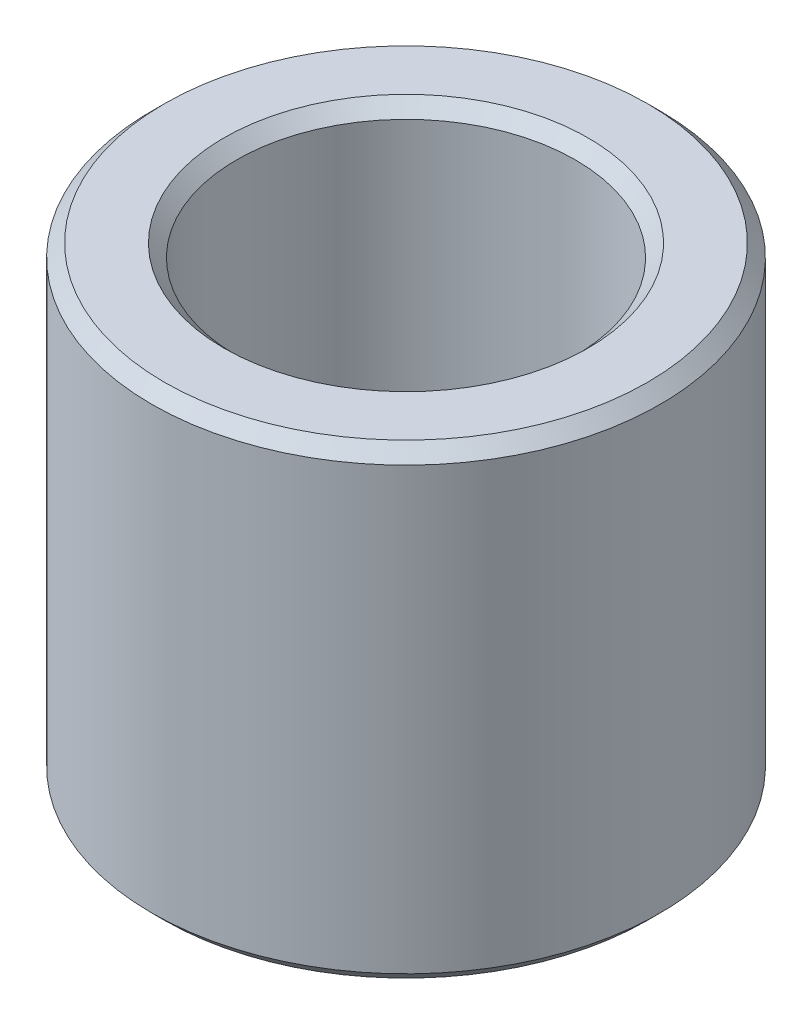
ISO-10303-21;
HEADER;
FILE_DESCRIPTION(('STEP AP214'),'2;1');
FILE_NAME('part.step','',(''),(''),'','','');
FILE_SCHEMA(('AUTOMOTIVE_DESIGN { 1 0 10303 214 1 1 1 1 }'));
ENDSEC;
DATA;
#1=APPLICATION_CONTEXT('core data for automotive mechanical design processes');
#2=APPLICATION_PROTOCOL_DEFINITION('international standard','automotive_design',2000,#1);
#3=PRODUCT_CONTEXT('',#1,'mechanical');
#4=PRODUCT('Part','Part','',(#3));
#5=PRODUCT_RELATED_PRODUCT_CATEGORY('part','',(#4));
#6=PRODUCT_DEFINITION_FORMATION('','',#4);
#7=PRODUCT_DEFINITION_CONTEXT('part definition',#1,'design');
#8=PRODUCT_DEFINITION('design','',#6,#7);
#9=PRODUCT_DEFINITION_SHAPE('','',#8);
#10=(LENGTH_UNIT() NAMED_UNIT(*) SI_UNIT(.MILLI.,.METRE.));
#11=(NAMED_UNIT(*) PLANE_ANGLE_UNIT() SI_UNIT($,.RADIAN.));
#12=(NAMED_UNIT(*) SI_UNIT($,.STERADIAN.) SOLID_ANGLE_UNIT());
#13=UNCERTAINTY_MEASURE_WITH_UNIT(LENGTH_MEASURE(1.E-05),#10,'distance_accuracy_value','');
#14=(GEOMETRIC_REPRESENTATION_CONTEXT(3) GLOBAL_UNCERTAINTY_ASSIGNED_CONTEXT((#13)) GLOBAL_UNIT_ASSIGNED_CONTEXT((#10,
#11,#12)) REPRESENTATION_CONTEXT('',''));
#15=CARTESIAN_POINT('',(0.,0.,0.));
#16=DIRECTION('',(0.,0.,1.));
#17=DIRECTION('',(1.,0.,0.));
#18=AXIS2_PLACEMENT_3D('',#15,#16,#17);
#19=CARTESIAN_POINT('',(6.,11.,0.));
#20=DIRECTION('',(0.,-1.,0.));
#21=DIRECTION('',(0.,0.,-1.));
#22=AXIS2_PLACEMENT_3D('',#19,#20,#21);
#23=PLANE('',#22);
#24=CARTESIAN_POINT('',(0.,11.,0.));
#25=DIRECTION('',(0.,-1.,0.));
#26=DIRECTION('',(0.,0.,-1.));
#27=AXIS2_PLACEMENT_3D('',#24,#25,#26);
#28=CIRCLE('',#27,4.30000000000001);
#29=CARTESIAN_POINT('',(0.,11.,4.30000000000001));
#30=VERTEX_POINT('',#29);
#31=EDGE_CURVE('E51',#30,#30,#28,.T.);
#32=ORIENTED_EDGE('',*,*,#31,.T.);
#33=EDGE_LOOP('',(#32));
#34=FACE_BOUND('',#33,.T.);
#35=CARTESIAN_POINT('',(0.,11.,0.));
#36=DIRECTION('',(0.,-1.,0.));
#37=DIRECTION('',(0.,0.,-1.));
#38=AXIS2_PLACEMENT_3D('',#35,#36,#37);
#39=CIRCLE('',#38,5.7);
#40=CARTESIAN_POINT('',(0.,11.,-5.7));
#41=VERTEX_POINT('',#40);
#42=EDGE_CURVE('E54',#41,#41,#39,.F.);
#43=ORIENTED_EDGE('',*,*,#42,.T.);
#44=EDGE_LOOP('',(#43));
#45=FACE_BOUND('',#44,.T.);
#46=ADVANCED_FACE('F32',(#34,#45),#23,.F.);
#47=CARTESIAN_POINT('',(0.,30.,0.));
#48=DIRECTION('',(0.,1.,0.));
#49=DIRECTION('',(0.,0.,1.));
#50=AXIS2_PLACEMENT_3D('',#47,#48,#49);
#51=CYLINDRICAL_SURFACE('',#50,6.);
#52=CARTESIAN_POINT('',(0.,10.7,0.));
#53=DIRECTION('',(0.,-1.,0.));
#54=DIRECTION('',(0.,0.,-1.));
#55=AXIS2_PLACEMENT_3D('',#52,#53,#54);
#56=CIRCLE('',#55,6.);
#57=CARTESIAN_POINT('',(0.,10.7,-6.));
#58=VERTEX_POINT('',#57);
#59=EDGE_CURVE('E42',#58,#58,#56,.T.);
#60=ORIENTED_EDGE('',*,*,#59,.T.);
#61=EDGE_LOOP('',(#60));
#62=FACE_BOUND('',#61,.T.);
#63=CARTESIAN_POINT('',(0.,0.300000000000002,0.));
#64=DIRECTION('',(0.,1.,0.));
#65=DIRECTION('',(0.,0.,1.));
#66=AXIS2_PLACEMENT_3D('',#63,#64,#65);
#67=CIRCLE('',#66,6.);
#68=CARTESIAN_POINT('',(0.,0.300000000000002,6.));
#69=VERTEX_POINT('',#68);
#70=EDGE_CURVE('E46',#69,#69,#67,.T.);
#71=ORIENTED_EDGE('',*,*,#70,.T.);
#72=EDGE_LOOP('',(#71));
#73=FACE_BOUND('',#72,.T.);
#74=ADVANCED_FACE('F78',(#62,#73),#51,.T.);
#75=CARTESIAN_POINT('',(4.,0.,0.));
#76=DIRECTION('',(0.,1.,0.));
#77=DIRECTION('',(0.,0.,1.));
#78=AXIS2_PLACEMENT_3D('',#75,#76,#77);
#79=PLANE('',#78);
#80=CARTESIAN_POINT('',(0.,0.,0.));
#81=DIRECTION('',(0.,1.,0.));
#82=DIRECTION('',(0.,0.,1.));
#83=AXIS2_PLACEMENT_3D('',#80,#81,#82);
#84=CIRCLE('',#83,5.7);
#85=CARTESIAN_POINT('',(0.,0.,5.70000000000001));
#86=VERTEX_POINT('',#85);
#87=EDGE_CURVE('E10',#86,#86,#84,.F.);
#88=ORIENTED_EDGE('',*,*,#87,.T.);
#89=EDGE_LOOP('',(#88));
#90=FACE_BOUND('',#89,.T.);
#91=CARTESIAN_POINT('',(0.,0.,0.));
#92=DIRECTION('',(0.,1.,0.));
#93=DIRECTION('',(0.,0.,1.));
#94=AXIS2_PLACEMENT_3D('',#91,#92,#93);
#95=CIRCLE('',#94,4.30000000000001);
#96=CARTESIAN_POINT('',(0.,0.,4.30000000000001));
#97=VERTEX_POINT('',#96);
#98=EDGE_CURVE('E38',#97,#97,#95,.T.);
#99=ORIENTED_EDGE('',*,*,#98,.T.);
#100=EDGE_LOOP('',(#99));
#101=FACE_BOUND('',#100,.T.);
#102=ADVANCED_FACE('F83',(#90,#101),#79,.F.);
#103=CARTESIAN_POINT('',(0.,30.,0.));
#104=DIRECTION('',(0.,1.,0.));
#105=DIRECTION('',(0.,0.,1.));
#106=AXIS2_PLACEMENT_3D('',#103,#104,#105);
#107=CYLINDRICAL_SURFACE('',#106,4.);
#108=CARTESIAN_POINT('',(0.,10.7,0.));
#109=DIRECTION('',(0.,-1.,0.));
#110=DIRECTION('',(0.,0.,-1.));
#111=AXIS2_PLACEMENT_3D('',#108,#109,#110);
#112=CIRCLE('',#111,4.);
#113=CARTESIAN_POINT('',(0.,10.7,4.));
#114=VERTEX_POINT('',#113);
#115=EDGE_CURVE('E57',#114,#114,#112,.F.);
#116=CARTESIAN_POINT('',(0.,0.300000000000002,0.));
#117=DIRECTION('',(0.,1.,0.));
#118=DIRECTION('',(0.,0.,1.));
#119=AXIS2_PLACEMENT_3D('',#116,#117,#118);
#120=CIRCLE('',#119,4.);
#121=CARTESIAN_POINT('',(0.,0.300000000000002,4.));
#122=VERTEX_POINT('',#121);
#123=EDGE_CURVE('E60',#122,#122,#120,.F.);
#124=CARTESIAN_POINT('',(0.,10.7,4.));
#125=CARTESIAN_POINT('',(0.,10.5916666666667,4.));
#126=CARTESIAN_POINT('',(0.,10.4833333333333,4.));
#127=CARTESIAN_POINT('',(0.,10.2666666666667,4.));
#128=CARTESIAN_POINT('',(0.,10.1583333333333,4.));
#129=CARTESIAN_POINT('',(0.,9.94166666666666,4.));
#130=CARTESIAN_POINT('',(0.,9.83333333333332,4.));
#131=CARTESIAN_POINT('',(0.,9.61666666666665,4.));
#132=CARTESIAN_POINT('',(0.,9.50833333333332,4.));
#133=CARTESIAN_POINT('',(0.,9.29166666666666,4.));
#134=CARTESIAN_POINT('',(0.,9.18333333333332,4.));
#135=CARTESIAN_POINT('',(0.,8.96666666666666,4.));
#136=CARTESIAN_POINT('',(0.,8.85833333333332,4.));
#137=CARTESIAN_POINT('',(0.,8.64166666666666,4.));
#138=CARTESIAN_POINT('',(0.,8.53333333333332,4.));
#139=CARTESIAN_POINT('',(0.,8.31666666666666,4.));
#140=CARTESIAN_POINT('',(0.,8.20833333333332,4.));
#141=CARTESIAN_POINT('',(0.,7.99166666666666,4.));
#142=CARTESIAN_POINT('',(0.,7.88333333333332,4.));
#143=CARTESIAN_POINT('',(0.,7.66666666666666,4.));
#144=CARTESIAN_POINT('',(0.,7.55833333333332,4.));
#145=CARTESIAN_POINT('',(0.,7.34166666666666,4.));
#146=CARTESIAN_POINT('',(0.,7.23333333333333,4.));
#147=CARTESIAN_POINT('',(0.,7.01666666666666,4.));
#148=CARTESIAN_POINT('',(0.,6.90833333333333,4.));
#149=CARTESIAN_POINT('',(0.,6.69166666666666,4.));
#150=CARTESIAN_POINT('',(0.,6.58333333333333,4.));
#151=CARTESIAN_POINT('',(0.,6.36666666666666,4.));
#152=CARTESIAN_POINT('',(0.,6.25833333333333,4.));
#153=CARTESIAN_POINT('',(0.,6.04166666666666,4.));
#154=CARTESIAN_POINT('',(0.,5.93333333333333,4.));
#155=CARTESIAN_POINT('',(0.,5.71666666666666,4.));
#156=CARTESIAN_POINT('',(0.,5.60833333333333,4.));
#157=CARTESIAN_POINT('',(0.,5.39166666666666,4.));
#158=CARTESIAN_POINT('',(0.,5.28333333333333,4.));
#159=CARTESIAN_POINT('',(0.,5.06666666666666,4.));
#160=CARTESIAN_POINT('',(0.,4.95833333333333,4.));
#161=CARTESIAN_POINT('',(0.,4.74166666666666,4.));
#162=CARTESIAN_POINT('',(0.,4.63333333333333,4.));
#163=CARTESIAN_POINT('',(0.,4.41666666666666,4.));
#164=CARTESIAN_POINT('',(0.,4.30833333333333,4.));
#165=CARTESIAN_POINT('',(0.,4.09166666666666,4.));
#166=CARTESIAN_POINT('',(0.,3.98333333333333,4.));
#167=CARTESIAN_POINT('',(0.,3.76666666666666,4.));
#168=CARTESIAN_POINT('',(0.,3.65833333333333,4.));
#169=CARTESIAN_POINT('',(0.,3.44166666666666,4.));
#170=CARTESIAN_POINT('',(0.,3.33333333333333,4.));
#171=CARTESIAN_POINT('',(0.,3.11666666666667,4.));
#172=CARTESIAN_POINT('',(0.,3.00833333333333,4.));
#173=CARTESIAN_POINT('',(0.,2.79166666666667,4.));
#174=CARTESIAN_POINT('',(0.,2.68333333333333,4.));
#175=CARTESIAN_POINT('',(0.,2.46666666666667,4.));
#176=CARTESIAN_POINT('',(0.,2.35833333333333,4.));
#177=CARTESIAN_POINT('',(0.,2.14166666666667,4.));
#178=CARTESIAN_POINT('',(0.,2.03333333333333,4.));
#179=CARTESIAN_POINT('',(0.,1.81666666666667,4.));
#180=CARTESIAN_POINT('',(0.,1.70833333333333,4.));
#181=CARTESIAN_POINT('',(0.,1.49166666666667,4.));
#182=CARTESIAN_POINT('',(0.,1.38333333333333,4.));
#183=CARTESIAN_POINT('',(0.,1.16666666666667,4.));
#184=CARTESIAN_POINT('',(0.,1.05833333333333,4.));
#185=CARTESIAN_POINT('',(0.,0.841666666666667,4.));
#186=CARTESIAN_POINT('',(0.,0.733333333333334,4.));
#187=CARTESIAN_POINT('',(0.,0.516666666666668,4.));
#188=CARTESIAN_POINT('',(0.,0.408333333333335,4.));
#189=CARTESIAN_POINT('',(0.,0.300000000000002,4.));
#190=B_SPLINE_CURVE_WITH_KNOTS('',3,(#124,#125,#126,#127,#128,#129,#130,#131,#132,#133,#134,
#135,#136,#137,#138,#139,#140,#141,#142,#143,#144,#145,#146,#147,#148,#149,#150,#151,#152,#153,
#154,#155,#156,#157,#158,#159,#160,#161,#162,#163,#164,#165,#166,#167,#168,#169,#170,#171,#172,
#173,#174,#175,#176,#177,#178,#179,#180,#181,#182,#183,#184,#185,#186,#187,#188,#189),
.UNSPECIFIED.,.F.,.F.,(4,2,2,2,2,2,2,2,2,2,2,2,2,2,2,2,2,2,2,2,2,2,2,2,2,2,2,2,2,2,2,2,4),(0.,
0.324999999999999,0.649999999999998,0.975,1.3,1.625,1.95,2.275,2.6,2.925,3.25,3.57499999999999,
3.89999999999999,4.22499999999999,4.54999999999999,4.87499999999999,5.19999999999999,
5.52499999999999,5.84999999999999,6.17499999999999,6.49999999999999,6.82499999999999,
7.14999999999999,7.47499999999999,7.79999999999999,8.12499999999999,8.44999999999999,
8.77499999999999,9.09999999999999,9.42499999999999,9.74999999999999,10.075,10.4),.UNSPECIFIED.);
#191=EDGE_CURVE('BSEAM64',#114,#122,#190,.T.);
#192=ORIENTED_EDGE('',*,*,#115,.T.);
#193=ORIENTED_EDGE('',*,*,#123,.T.);
#194=ORIENTED_EDGE('',*,*,#191,.T.);
#195=ORIENTED_EDGE('',*,*,#191,.F.);
#196=EDGE_LOOP('',(#192,#194,#193,#195));
#197=FACE_BOUND('',#196,.T.);
#198=ADVANCED_FACE('F64',(#197),#107,.F.);
#199=CARTESIAN_POINT('',(0.,10.7,0.));
#200=DIRECTION('',(0.,1.,0.));
#201=DIRECTION('',(0.,0.,1.));
#202=AXIS2_PLACEMENT_3D('',#199,#200,#201);
#203=CONICAL_SURFACE('',#202,4.,0.785398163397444);
#204=CARTESIAN_POINT('',(0.,11.,4.30000000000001));
#205=CARTESIAN_POINT('',(0.,10.996875,4.29687500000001));
#206=CARTESIAN_POINT('',(0.,10.99375,4.29375000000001));
#207=CARTESIAN_POINT('',(0.,10.9875,4.28750000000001));
#208=CARTESIAN_POINT('',(0.,10.984375,4.28437500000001));
#209=CARTESIAN_POINT('',(0.,10.978125,4.27812500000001));
#210=CARTESIAN_POINT('',(0.,10.975,4.27500000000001));
#211=CARTESIAN_POINT('',(0.,10.96875,4.26875000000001));
#212=CARTESIAN_POINT('',(0.,10.965625,4.26562500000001));
#213=CARTESIAN_POINT('',(0.,10.959375,4.25937500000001));
#214=CARTESIAN_POINT('',(0.,10.95625,4.25625000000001));
#215=CARTESIAN_POINT('',(0.,10.95,4.25000000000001));
#216=CARTESIAN_POINT('',(0.,10.946875,4.24687500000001));
#217=CARTESIAN_POINT('',(0.,10.940625,4.24062500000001));
#218=CARTESIAN_POINT('',(0.,10.9375,4.23750000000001));
#219=CARTESIAN_POINT('',(0.,10.93125,4.23125000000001));
#220=CARTESIAN_POINT('',(0.,10.928125,4.22812500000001));
#221=CARTESIAN_POINT('',(0.,10.921875,4.22187500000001));
#222=CARTESIAN_POINT('',(0.,10.91875,4.21875000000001));
#223=CARTESIAN_POINT('',(0.,10.9125,4.21250000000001));
#224=CARTESIAN_POINT('',(0.,10.909375,4.20937500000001));
#225=CARTESIAN_POINT('',(0.,10.903125,4.20312500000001));
#226=CARTESIAN_POINT('',(0.,10.9,4.20000000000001));
#227=CARTESIAN_POINT('',(0.,10.89375,4.19375000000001));
#228=CARTESIAN_POINT('',(0.,10.890625,4.19062500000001));
#229=CARTESIAN_POINT('',(0.,10.884375,4.18437500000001));
#230=CARTESIAN_POINT('',(0.,10.88125,4.18125000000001));
#231=CARTESIAN_POINT('',(0.,10.875,4.17500000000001));
#232=CARTESIAN_POINT('',(0.,10.871875,4.17187500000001));
#233=CARTESIAN_POINT('',(0.,10.865625,4.16562500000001));
#234=CARTESIAN_POINT('',(0.,10.8625,4.16250000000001));
#235=CARTESIAN_POINT('',(0.,10.85625,4.15625000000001));
#236=CARTESIAN_POINT('',(0.,10.853125,4.15312500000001));
#237=CARTESIAN_POINT('',(0.,10.846875,4.14687500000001));
#238=CARTESIAN_POINT('',(0.,10.84375,4.14375000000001));
#239=CARTESIAN_POINT('',(0.,10.8375,4.13750000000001));
#240=CARTESIAN_POINT('',(0.,10.834375,4.13437500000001));
#241=CARTESIAN_POINT('',(0.,10.828125,4.12812500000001));
#242=CARTESIAN_POINT('',(0.,10.825,4.12500000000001));
#243=CARTESIAN_POINT('',(0.,10.81875,4.11875000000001));
#244=CARTESIAN_POINT('',(0.,10.815625,4.11562500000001));
#245=CARTESIAN_POINT('',(0.,10.809375,4.10937500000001));
#246=CARTESIAN_POINT('',(0.,10.80625,4.10625));
#247=CARTESIAN_POINT('',(0.,10.8,4.1));
#248=CARTESIAN_POINT('',(0.,10.796875,4.09687500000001));
#249=CARTESIAN_POINT('',(0.,10.790625,4.09062500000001));
#250=CARTESIAN_POINT('',(0.,10.7875,4.0875));
#251=CARTESIAN_POINT('',(0.,10.78125,4.08125000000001));
#252=CARTESIAN_POINT('',(0.,10.778125,4.07812500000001));
#253=CARTESIAN_POINT('',(0.,10.771875,4.071875));
#254=CARTESIAN_POINT('',(0.,10.76875,4.06875));
#255=CARTESIAN_POINT('',(0.,10.7625,4.0625));
#256=CARTESIAN_POINT('',(0.,10.759375,4.059375));
#257=CARTESIAN_POINT('',(0.,10.753125,4.053125));
#258=CARTESIAN_POINT('',(0.,10.75,4.05));
#259=CARTESIAN_POINT('',(0.,10.74375,4.04375));
#260=CARTESIAN_POINT('',(0.,10.740625,4.040625));
#261=CARTESIAN_POINT('',(0.,10.734375,4.03437500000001));
#262=CARTESIAN_POINT('',(0.,10.73125,4.03125));
#263=CARTESIAN_POINT('',(0.,10.725,4.025));
#264=CARTESIAN_POINT('',(0.,10.721875,4.021875));
#265=CARTESIAN_POINT('',(0.,10.715625,4.015625));
#266=CARTESIAN_POINT('',(0.,10.7125,4.0125));
#267=CARTESIAN_POINT('',(0.,10.70625,4.00625));
#268=CARTESIAN_POINT('',(0.,10.703125,4.003125));
#269=CARTESIAN_POINT('',(0.,10.7,4.));
#270=B_SPLINE_CURVE_WITH_KNOTS('',3,(#204,#205,#206,#207,#208,#209,#210,#211,#212,#213,#214,
#215,#216,#217,#218,#219,#220,#221,#222,#223,#224,#225,#226,#227,#228,#229,#230,#231,#232,#233,
#234,#235,#236,#237,#238,#239,#240,#241,#242,#243,#244,#245,#246,#247,#248,#249,#250,#251,#252,
#253,#254,#255,#256,#257,#258,#259,#260,#261,#262,#263,#264,#265,#266,#267,#268,#269),
.UNSPECIFIED.,.F.,.F.,(4,2,2,2,2,2,2,2,2,2,2,2,2,2,2,2,2,2,2,2,2,2,2,2,2,2,2,2,2,2,2,2,4),(0.,
0.0132582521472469,0.0265165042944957,0.0397747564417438,0.0530330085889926,0.0662912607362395,
0.0795495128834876,0.0928077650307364,0.106066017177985,0.119324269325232,0.13258252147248,
0.145840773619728,0.159099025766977,0.172357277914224,0.185615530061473,0.198873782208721,
0.21213203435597,0.225390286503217,0.238648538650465,0.251906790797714,0.265165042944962,
0.278423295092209,0.291681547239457,0.304939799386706,0.318198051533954,0.331456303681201,
0.34471455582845,0.357972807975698,0.371231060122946,0.384489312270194,0.397747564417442,
0.411005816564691,0.424264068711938),.UNSPECIFIED.);
#271=EDGE_CURVE('BSEAM90',#30,#114,#270,.T.);
#272=ORIENTED_EDGE('',*,*,#31,.F.);
#273=ORIENTED_EDGE('',*,*,#115,.F.);
#274=ORIENTED_EDGE('',*,*,#271,.T.);
#275=ORIENTED_EDGE('',*,*,#271,.F.);
#276=EDGE_LOOP('',(#272,#274,#273,#275));
#277=FACE_BOUND('',#276,.T.);
#278=ADVANCED_FACE('F90',(#277),#203,.F.);
#279=CARTESIAN_POINT('',(0.,11.,0.));
#280=DIRECTION('',(0.,-1.,0.));
#281=DIRECTION('',(0.,0.,-1.));
#282=AXIS2_PLACEMENT_3D('',#279,#280,#281);
#283=CONICAL_SURFACE('',#282,5.7,0.785398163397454);
#284=ORIENTED_EDGE('',*,*,#59,.F.);
#285=EDGE_LOOP('',(#284));
#286=FACE_BOUND('',#285,.T.);
#287=ORIENTED_EDGE('',*,*,#42,.F.);
#288=EDGE_LOOP('',(#287));
#289=FACE_BOUND('',#288,.T.);
#290=ADVANCED_FACE('F74',(#286,#289),#283,.T.);
#291=CARTESIAN_POINT('',(0.,0.300000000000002,0.));
#292=DIRECTION('',(0.,1.,0.));
#293=DIRECTION('',(0.,0.,1.));
#294=AXIS2_PLACEMENT_3D('',#291,#292,#293);
#295=CONICAL_SURFACE('',#294,6.,0.785398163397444);
#296=CARTESIAN_POINT('',(0.,0.,5.70000000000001));
#297=CARTESIAN_POINT('',(0.,0.00312499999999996,5.70312500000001));
#298=CARTESIAN_POINT('',(0.,0.00624999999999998,5.70625000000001));
#299=CARTESIAN_POINT('',(0.,0.0125,5.7125));
#300=CARTESIAN_POINT('',(0.,0.015625,5.71562500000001));
#301=CARTESIAN_POINT('',(0.,0.0218750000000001,5.72187500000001));
#302=CARTESIAN_POINT('',(0.,0.0250000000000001,5.725));
#303=CARTESIAN_POINT('',(0.,0.0312500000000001,5.73125));
#304=CARTESIAN_POINT('',(0.,0.0343750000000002,5.73437500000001));
#305=CARTESIAN_POINT('',(0.,0.0406250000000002,5.740625));
#306=CARTESIAN_POINT('',(0.,0.0437500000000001,5.74375));
#307=CARTESIAN_POINT('',(0.,0.0500000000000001,5.75000000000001));
#308=CARTESIAN_POINT('',(0.,0.0531250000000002,5.75312500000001));
#309=CARTESIAN_POINT('',(0.,0.0593750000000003,5.759375));
#310=CARTESIAN_POINT('',(0.,0.0625000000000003,5.76250000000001));
#311=CARTESIAN_POINT('',(0.,0.0687500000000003,5.76875000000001));
#312=CARTESIAN_POINT('',(0.,0.0718750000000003,5.771875));
#313=CARTESIAN_POINT('',(0.,0.0781250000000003,5.778125));
#314=CARTESIAN_POINT('',(0.,0.0812500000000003,5.78125000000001));
#315=CARTESIAN_POINT('',(0.,0.0875000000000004,5.7875));
#316=CARTESIAN_POINT('',(0.,0.0906250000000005,5.790625));
#317=CARTESIAN_POINT('',(0.,0.0968750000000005,5.79687500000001));
#318=CARTESIAN_POINT('',(0.,0.1,5.80000000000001));
#319=CARTESIAN_POINT('',(0.,0.10625,5.80625));
#320=CARTESIAN_POINT('',(0.,0.109375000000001,5.80937500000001));
#321=CARTESIAN_POINT('',(0.,0.115625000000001,5.81562500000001));
#322=CARTESIAN_POINT('',(0.,0.118750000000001,5.81875));
#323=CARTESIAN_POINT('',(0.,0.125000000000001,5.825));
#324=CARTESIAN_POINT('',(0.,0.128125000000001,5.82812500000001));
#325=CARTESIAN_POINT('',(0.,0.134375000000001,5.834375));
#326=CARTESIAN_POINT('',(0.,0.137500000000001,5.8375));
#327=CARTESIAN_POINT('',(0.,0.143750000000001,5.84375));
#328=CARTESIAN_POINT('',(0.,0.146875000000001,5.84687500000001));
#329=CARTESIAN_POINT('',(0.,0.153125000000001,5.853125));
#330=CARTESIAN_POINT('',(0.,0.156250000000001,5.85625));
#331=CARTESIAN_POINT('',(0.,0.162500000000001,5.86250000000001));
#332=CARTESIAN_POINT('',(0.,0.165625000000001,5.865625));
#333=CARTESIAN_POINT('',(0.,0.171875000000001,5.871875));
#334=CARTESIAN_POINT('',(0.,0.175000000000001,5.87500000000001));
#335=CARTESIAN_POINT('',(0.,0.181250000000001,5.88125));
#336=CARTESIAN_POINT('',(0.,0.184375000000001,5.884375));
#337=CARTESIAN_POINT('',(0.,0.190625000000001,5.890625));
#338=CARTESIAN_POINT('',(0.,0.193750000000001,5.89375000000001));
#339=CARTESIAN_POINT('',(0.,0.200000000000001,5.9));
#340=CARTESIAN_POINT('',(0.,0.203125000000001,5.903125));
#341=CARTESIAN_POINT('',(0.,0.209375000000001,5.909375));
#342=CARTESIAN_POINT('',(0.,0.212500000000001,5.9125));
#343=CARTESIAN_POINT('',(0.,0.218750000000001,5.91875));
#344=CARTESIAN_POINT('',(0.,0.221875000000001,5.921875));
#345=CARTESIAN_POINT('',(0.,0.228125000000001,5.928125));
#346=CARTESIAN_POINT('',(0.,0.231250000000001,5.93125));
#347=CARTESIAN_POINT('',(0.,0.237500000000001,5.9375));
#348=CARTESIAN_POINT('',(0.,0.240625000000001,5.94062500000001));
#349=CARTESIAN_POINT('',(0.,0.246875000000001,5.946875));
#350=CARTESIAN_POINT('',(0.,0.250000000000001,5.95));
#351=CARTESIAN_POINT('',(0.,0.256250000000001,5.95625));
#352=CARTESIAN_POINT('',(0.,0.259375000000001,5.959375));
#353=CARTESIAN_POINT('',(0.,0.265625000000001,5.965625));
#354=CARTESIAN_POINT('',(0.,0.268750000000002,5.96875));
#355=CARTESIAN_POINT('',(0.,0.275000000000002,5.975));
#356=CARTESIAN_POINT('',(0.,0.278125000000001,5.978125));
#357=CARTESIAN_POINT('',(0.,0.284375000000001,5.984375));
#358=CARTESIAN_POINT('',(0.,0.287500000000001,5.98750000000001));
#359=CARTESIAN_POINT('',(0.,0.293750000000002,5.99375));
#360=CARTESIAN_POINT('',(0.,0.296875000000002,5.996875));
#361=CARTESIAN_POINT('',(0.,0.300000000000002,6.));
#362=B_SPLINE_CURVE_WITH_KNOTS('',3,(#296,#297,#298,#299,#300,#301,#302,#303,#304,#305,#306,
#307,#308,#309,#310,#311,#312,#313,#314,#315,#316,#317,#318,#319,#320,#321,#322,#323,#324,#325,
#326,#327,#328,#329,#330,#331,#332,#333,#334,#335,#336,#337,#338,#339,#340,#341,#342,#343,#344,
#345,#346,#347,#348,#349,#350,#351,#352,#353,#354,#355,#356,#357,#358,#359,#360,#361),
.UNSPECIFIED.,.F.,.F.,(4,2,2,2,2,2,2,2,2,2,2,2,2,2,2,2,2,2,2,2,2,2,2,2,2,2,2,2,2,2,2,2,4),(0.,
0.0132582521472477,0.0265165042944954,0.0397747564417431,0.0530330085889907,0.066291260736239,
0.0795495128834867,0.0928077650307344,0.106066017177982,0.11932426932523,0.132582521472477,
0.145840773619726,0.159099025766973,0.172357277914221,0.185615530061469,0.198873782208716,
0.212132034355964,0.225390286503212,0.23864853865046,0.251906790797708,0.265165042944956,
0.278423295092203,0.291681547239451,0.304939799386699,0.318198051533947,0.331456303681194,
0.344714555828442,0.35797280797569,0.371231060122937,0.384489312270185,0.397747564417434,
0.411005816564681,0.424264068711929),.UNSPECIFIED.);
#363=EDGE_CURVE('BSEAM69',#86,#69,#362,.T.);
#364=ORIENTED_EDGE('',*,*,#87,.F.);
#365=ORIENTED_EDGE('',*,*,#70,.F.);
#366=ORIENTED_EDGE('',*,*,#363,.T.);
#367=ORIENTED_EDGE('',*,*,#363,.F.);
#368=EDGE_LOOP('',(#364,#366,#365,#367));
#369=FACE_BOUND('',#368,.T.);
#370=ADVANCED_FACE('F69',(#369),#295,.T.);
#371=CARTESIAN_POINT('',(0.,0.,0.));
#372=DIRECTION('',(0.,-1.,0.));
#373=DIRECTION('',(0.,0.,-1.));
#374=AXIS2_PLACEMENT_3D('',#371,#372,#373);
#375=CONICAL_SURFACE('',#374,4.30000000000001,0.785398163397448);
#376=ORIENTED_EDGE('',*,*,#123,.F.);
#377=EDGE_LOOP('',(#376));
#378=FACE_BOUND('',#377,.T.);
#379=ORIENTED_EDGE('',*,*,#98,.F.);
#380=EDGE_LOOP('',(#379));
#381=FACE_BOUND('',#380,.T.);
#382=ADVANCED_FACE('F66',(#378,#381),#375,.F.);
#383=CLOSED_SHELL('',(#46,#74,#102,#198,#278,#290,#370,#382));
#384=MANIFOLD_SOLID_BREP('B2',#383);
#385=ADVANCED_BREP_SHAPE_REPRESENTATION('',(#18,#384),#14);
#386=SHAPE_DEFINITION_REPRESENTATION(#9,#385);
ENDSEC;
END-ISO-10303-21;
